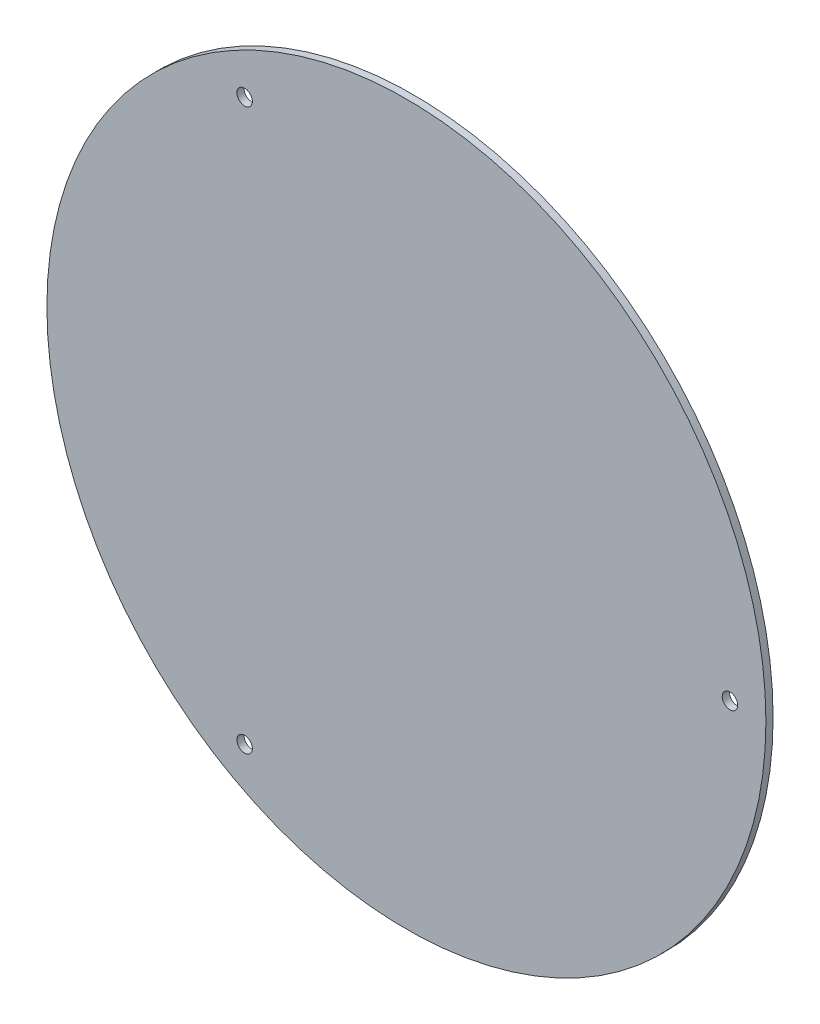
from build123d import *

# Parameters (mm, degrees)
ESQUISSE3_R        = 100
ESQUISSE3_R_2      = 2.15
BOSS_EXTRU_3_DEPTH = 1


with BuildPart() as part:
    # Esquisse3 → Boss.-Extru.3 (new, symmetric)
    with BuildSketch(Plane.XY):
        Circle(ESQUISSE3_R)
        with Locations((90, 0)):
            Circle(ESQUISSE3_R_2, mode=Mode.SUBTRACT)
        with Locations((-45, -77.942286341)):
            Circle(ESQUISSE3_R_2, mode=Mode.SUBTRACT)
        with Locations((-45, 77.942286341)):
            Circle(ESQUISSE3_R_2, mode=Mode.SUBTRACT)
    extrude(amount=BOSS_EXTRU_3_DEPTH, both=True)


solid = part.part
